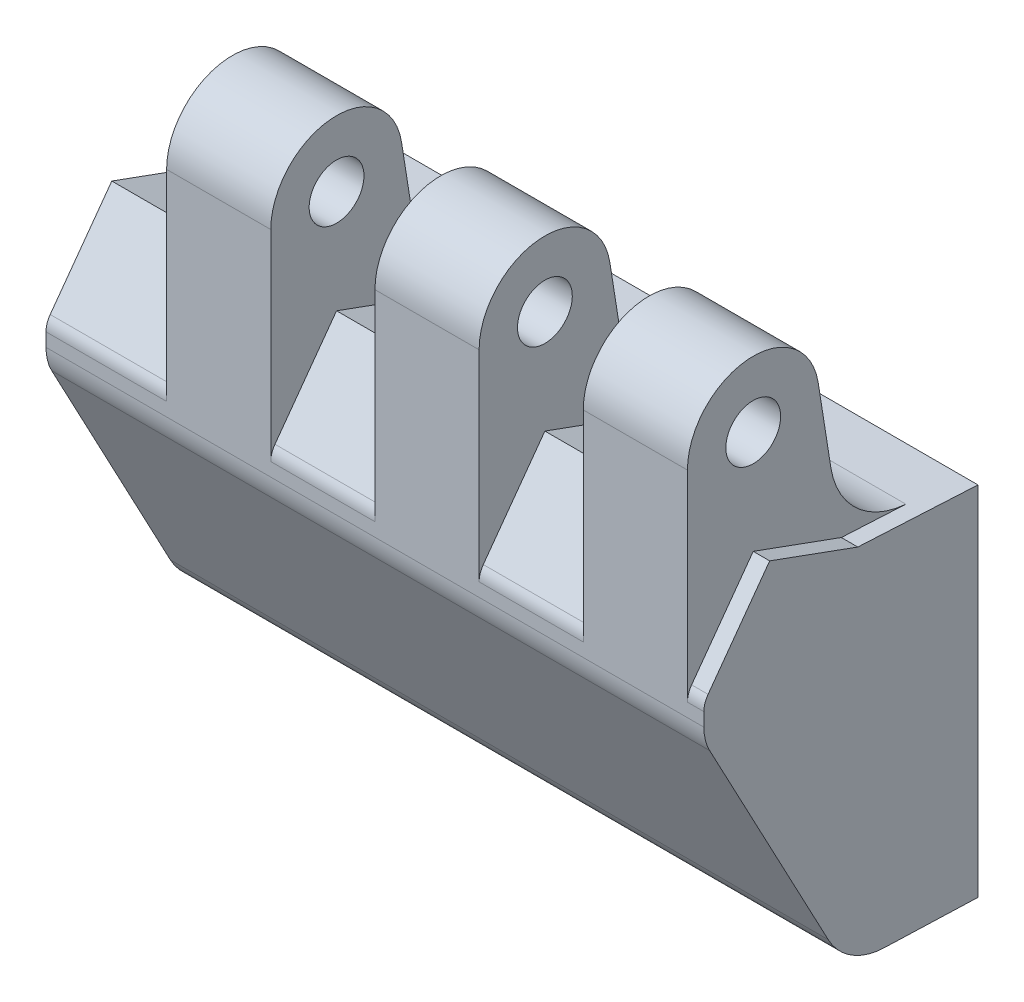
ISO-10303-21;
HEADER;
FILE_DESCRIPTION(('STEP AP214'),'2;1');
FILE_NAME('part.step','',(''),(''),'','','');
FILE_SCHEMA(('AUTOMOTIVE_DESIGN { 1 0 10303 214 1 1 1 1 }'));
ENDSEC;
DATA;
#1=APPLICATION_CONTEXT('core data for automotive mechanical design processes');
#2=APPLICATION_PROTOCOL_DEFINITION('international standard','automotive_design',2000,#1);
#3=PRODUCT_CONTEXT('',#1,'mechanical');
#4=PRODUCT('Part','Part','',(#3));
#5=PRODUCT_RELATED_PRODUCT_CATEGORY('part','',(#4));
#6=PRODUCT_DEFINITION_FORMATION('','',#4);
#7=PRODUCT_DEFINITION_CONTEXT('part definition',#1,'design');
#8=PRODUCT_DEFINITION('design','',#6,#7);
#9=PRODUCT_DEFINITION_SHAPE('','',#8);
#10=(LENGTH_UNIT() NAMED_UNIT(*) SI_UNIT(.MILLI.,.METRE.));
#11=(NAMED_UNIT(*) PLANE_ANGLE_UNIT() SI_UNIT($,.RADIAN.));
#12=(NAMED_UNIT(*) SI_UNIT($,.STERADIAN.) SOLID_ANGLE_UNIT());
#13=UNCERTAINTY_MEASURE_WITH_UNIT(LENGTH_MEASURE(1.E-05),#10,'distance_accuracy_value','');
#14=(GEOMETRIC_REPRESENTATION_CONTEXT(3) GLOBAL_UNCERTAINTY_ASSIGNED_CONTEXT((#13)) GLOBAL_UNIT_ASSIGNED_CONTEXT((#10,
#11,#12)) REPRESENTATION_CONTEXT('',''));
#15=CARTESIAN_POINT('',(0.,0.,0.));
#16=DIRECTION('',(0.,0.,1.));
#17=DIRECTION('',(1.,0.,0.));
#18=AXIS2_PLACEMENT_3D('',#15,#16,#17);
#19=CARTESIAN_POINT('',(-7.75,8.54,0.));
#20=DIRECTION('',(0.,0.998629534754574,-0.0523359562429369));
#21=DIRECTION('',(0.,0.0523359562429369,0.998629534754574));
#22=AXIS2_PLACEMENT_3D('',#19,#20,#21);
#23=PLANE('',#22);
#24=DIRECTION('',(1.,0.,0.));
#25=VECTOR('',#24,1.);
#26=CARTESIAN_POINT('',(-7.75,8.54,0.));
#27=LINE('',#26,#25);
#28=CARTESIAN_POINT('',(-7.5,8.54,0.));
#29=VERTEX_POINT('',#28);
#30=CARTESIAN_POINT('',(22.5,8.54,0.));
#31=VERTEX_POINT('',#30);
#32=EDGE_CURVE('E260',#29,#31,#27,.T.);
#33=ORIENTED_EDGE('',*,*,#32,.F.);
#34=DIRECTION('',(0.,-0.0523359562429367,-0.998629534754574));
#35=VECTOR('',#34,1.);
#36=CARTESIAN_POINT('',(-7.5,8.8272543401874,5.4811393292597));
#37=LINE('',#36,#35);
#38=CARTESIAN_POINT('',(-7.5,8.8272543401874,5.4811393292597));
#39=VERTEX_POINT('',#38);
#40=EDGE_CURVE('E242',#39,#29,#37,.T.);
#41=ORIENTED_EDGE('',*,*,#40,.F.);
#42=DIRECTION('',(1.,0.,0.));
#43=VECTOR('',#42,1.);
#44=CARTESIAN_POINT('',(-7.75,8.8272543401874,5.4811393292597));
#45=LINE('',#44,#43);
#46=CARTESIAN_POINT('',(-2.,8.8272543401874,5.4811393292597));
#47=VERTEX_POINT('',#46);
#48=EDGE_CURVE('E263',#39,#47,#45,.T.);
#49=ORIENTED_EDGE('',*,*,#48,.T.);
#50=DIRECTION('',(0.,0.0523359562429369,0.998629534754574));
#51=VECTOR('',#50,1.);
#52=CARTESIAN_POINT('',(-2.,8.54,0.));
#53=LINE('',#52,#51);
#54=CARTESIAN_POINT('',(-2.,8.67304490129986,2.53864794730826));
#55=VERTEX_POINT('',#54);
#56=EDGE_CURVE('E284',#55,#47,#53,.T.);
#57=ORIENTED_EDGE('',*,*,#56,.F.);
#58=DIRECTION('',(1.,0.,0.));
#59=VECTOR('',#58,1.);
#60=CARTESIAN_POINT('',(-2.,8.67304490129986,2.53864794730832));
#61=LINE('',#60,#59);
#62=CARTESIAN_POINT('',(2.75,8.67304490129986,2.53864794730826));
#63=VERTEX_POINT('',#62);
#64=EDGE_CURVE('E24',#63,#55,#61,.F.);
#65=ORIENTED_EDGE('',*,*,#64,.F.);
#66=DIRECTION('',(0.,0.0523359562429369,0.998629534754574));
#67=VECTOR('',#66,1.);
#68=CARTESIAN_POINT('',(2.75,8.54,0.));
#69=LINE('',#68,#67);
#70=CARTESIAN_POINT('',(2.75,8.8272543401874,5.4811393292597));
#71=VERTEX_POINT('',#70);
#72=EDGE_CURVE('E451',#63,#71,#69,.T.);
#73=ORIENTED_EDGE('',*,*,#72,.T.);
#74=CARTESIAN_POINT('',(7.5,8.8272543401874,5.4811393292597));
#75=VERTEX_POINT('',#74);
#76=EDGE_CURVE('E377',#71,#75,#45,.T.);
#77=ORIENTED_EDGE('',*,*,#76,.T.);
#78=DIRECTION('',(0.,0.0523359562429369,0.998629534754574));
#79=VECTOR('',#78,1.);
#80=CARTESIAN_POINT('',(7.5,8.54,0.));
#81=LINE('',#80,#79);
#82=CARTESIAN_POINT('',(7.5,8.67304490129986,2.53864794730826));
#83=VERTEX_POINT('',#82);
#84=EDGE_CURVE('E345',#83,#75,#81,.T.);
#85=ORIENTED_EDGE('',*,*,#84,.F.);
#86=DIRECTION('',(-1.,0.,0.));
#87=VECTOR('',#86,1.);
#88=CARTESIAN_POINT('',(12.25,8.67304490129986,2.53864794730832));
#89=LINE('',#88,#87);
#90=CARTESIAN_POINT('',(12.25,8.67304490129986,2.53864794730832));
#91=VERTEX_POINT('',#90);
#92=EDGE_CURVE('E259',#83,#91,#89,.F.);
#93=ORIENTED_EDGE('',*,*,#92,.T.);
#94=DIRECTION('',(0.,0.0523359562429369,0.998629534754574));
#95=VECTOR('',#94,1.);
#96=CARTESIAN_POINT('',(12.25,8.54,0.));
#97=LINE('',#96,#95);
#98=CARTESIAN_POINT('',(12.25,8.8272543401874,5.4811393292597));
#99=VERTEX_POINT('',#98);
#100=EDGE_CURVE('E354',#91,#99,#97,.T.);
#101=ORIENTED_EDGE('',*,*,#100,.T.);
#102=CARTESIAN_POINT('',(17.,8.8272543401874,5.4811393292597));
#103=VERTEX_POINT('',#102);
#104=EDGE_CURVE('E378',#99,#103,#45,.T.);
#105=ORIENTED_EDGE('',*,*,#104,.T.);
#106=DIRECTION('',(0.,0.0523359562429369,0.998629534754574));
#107=VECTOR('',#106,1.);
#108=CARTESIAN_POINT('',(17.,8.54,0.));
#109=LINE('',#108,#107);
#110=CARTESIAN_POINT('',(17.,8.67304490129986,2.53864794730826));
#111=VERTEX_POINT('',#110);
#112=EDGE_CURVE('E383',#111,#103,#109,.T.);
#113=ORIENTED_EDGE('',*,*,#112,.F.);
#114=DIRECTION('',(-1.,0.,0.));
#115=VECTOR('',#114,1.);
#116=CARTESIAN_POINT('',(21.75,8.67304490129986,2.53864794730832));
#117=LINE('',#116,#115);
#118=CARTESIAN_POINT('',(21.75,8.67304490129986,2.53864794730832));
#119=VERTEX_POINT('',#118);
#120=EDGE_CURVE('E10',#111,#119,#117,.F.);
#121=ORIENTED_EDGE('',*,*,#120,.T.);
#122=DIRECTION('',(0.,0.0523359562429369,0.998629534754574));
#123=VECTOR('',#122,1.);
#124=CARTESIAN_POINT('',(21.75,8.54,0.));
#125=LINE('',#124,#123);
#126=CARTESIAN_POINT('',(21.75,8.8272543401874,5.4811393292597));
#127=VERTEX_POINT('',#126);
#128=EDGE_CURVE('E408',#119,#127,#125,.T.);
#129=ORIENTED_EDGE('',*,*,#128,.T.);
#130=CARTESIAN_POINT('',(22.5,8.8272543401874,5.4811393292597));
#131=VERTEX_POINT('',#130);
#132=EDGE_CURVE('E374',#127,#131,#45,.T.);
#133=ORIENTED_EDGE('',*,*,#132,.T.);
#134=DIRECTION('',(0.,0.0523359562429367,0.998629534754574));
#135=VECTOR('',#134,1.);
#136=CARTESIAN_POINT('',(22.5,8.54,0.));
#137=LINE('',#136,#135);
#138=EDGE_CURVE('E654',#31,#131,#137,.T.);
#139=ORIENTED_EDGE('',*,*,#138,.F.);
#140=EDGE_LOOP('',(#33,#41,#49,#57,#65,#73,#77,#85,#93,#101,#105,#113,#121,#129,#133,#139));
#141=FACE_BOUND('',#140,.T.);
#142=ADVANCED_FACE('F16',(#141),#23,.T.);
#143=CARTESIAN_POINT('',(-7.75,-7.600480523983,4.2816775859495));
#144=DIRECTION('',(0.,-0.999390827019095,0.0348994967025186));
#145=DIRECTION('',(0.,-0.0348994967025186,-0.999390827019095));
#146=AXIS2_PLACEMENT_3D('',#143,#144,#145);
#147=PLANE('',#146);
#148=DIRECTION('',(1.,0.,0.));
#149=VECTOR('',#148,1.);
#150=CARTESIAN_POINT('',(-7.75,-7.600480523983,4.2816775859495));
#151=LINE('',#150,#149);
#152=CARTESIAN_POINT('',(-7.5,-7.600480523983,4.2816775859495));
#153=VERTEX_POINT('',#152);
#154=CARTESIAN_POINT('',(22.5,-7.600480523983,4.2816775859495));
#155=VERTEX_POINT('',#154);
#156=EDGE_CURVE('E252',#153,#155,#151,.T.);
#157=ORIENTED_EDGE('',*,*,#156,.F.);
#158=DIRECTION('',(0.,0.0348994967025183,0.999390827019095));
#159=VECTOR('',#158,1.);
#160=CARTESIAN_POINT('',(-7.5,-7.75,0.));
#161=LINE('',#160,#159);
#162=CARTESIAN_POINT('',(-7.5,-7.75,0.));
#163=VERTEX_POINT('',#162);
#164=EDGE_CURVE('E239',#163,#153,#161,.T.);
#165=ORIENTED_EDGE('',*,*,#164,.F.);
#166=DIRECTION('',(1.,0.,0.));
#167=VECTOR('',#166,1.);
#168=CARTESIAN_POINT('',(-7.75,-7.75,0.));
#169=LINE('',#168,#167);
#170=CARTESIAN_POINT('',(22.5,-7.75,0.));
#171=VERTEX_POINT('',#170);
#172=EDGE_CURVE('E250',#163,#171,#169,.T.);
#173=ORIENTED_EDGE('',*,*,#172,.T.);
#174=DIRECTION('',(0.,-0.0348994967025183,-0.999390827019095));
#175=VECTOR('',#174,1.);
#176=CARTESIAN_POINT('',(22.5,-7.600480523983,4.2816775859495));
#177=LINE('',#176,#175);
#178=EDGE_CURVE('E658',#155,#171,#177,.T.);
#179=ORIENTED_EDGE('',*,*,#178,.F.);
#180=EDGE_LOOP('',(#157,#165,#173,#179));
#181=FACE_BOUND('',#180,.T.);
#182=ADVANCED_FACE('F18',(#181),#147,.T.);
#183=CARTESIAN_POINT('',(-7.75,-7.75,0.));
#184=DIRECTION('',(0.,0.,-1.));
#185=DIRECTION('',(-1.,0.,0.));
#186=AXIS2_PLACEMENT_3D('',#183,#184,#185);
#187=PLANE('',#186);
#188=CARTESIAN_POINT('',(0.,0.,0.));
#189=DIRECTION('',(0.,0.,-1.));
#190=DIRECTION('',(-1.,0.,0.));
#191=AXIS2_PLACEMENT_3D('',#188,#189,#190);
#192=CIRCLE('',#191,1.5);
#193=CARTESIAN_POINT('',(-1.5,0.,0.));
#194=VERTEX_POINT('',#193);
#195=EDGE_CURVE('E585',#194,#194,#192,.T.);
#196=ORIENTED_EDGE('',*,*,#195,.F.);
#197=EDGE_LOOP('',(#196));
#198=FACE_BOUND('',#197,.T.);
#199=CARTESIAN_POINT('',(15.,0.,0.));
#200=DIRECTION('',(0.,0.,-1.));
#201=DIRECTION('',(-1.,0.,0.));
#202=AXIS2_PLACEMENT_3D('',#199,#200,#201);
#203=CIRCLE('',#202,1.5);
#204=CARTESIAN_POINT('',(13.5,0.,0.));
#205=VERTEX_POINT('',#204);
#206=EDGE_CURVE('E588',#205,#205,#203,.T.);
#207=ORIENTED_EDGE('',*,*,#206,.F.);
#208=EDGE_LOOP('',(#207));
#209=FACE_BOUND('',#208,.T.);
#210=ORIENTED_EDGE('',*,*,#172,.F.);
#211=DIRECTION('',(0.,-1.,0.));
#212=VECTOR('',#211,1.);
#213=CARTESIAN_POINT('',(-7.5,8.54,0.));
#214=LINE('',#213,#212);
#215=EDGE_CURVE('E236',#29,#163,#214,.T.);
#216=ORIENTED_EDGE('',*,*,#215,.F.);
#217=ORIENTED_EDGE('',*,*,#32,.T.);
#218=DIRECTION('',(0.,1.,0.));
#219=VECTOR('',#218,1.);
#220=CARTESIAN_POINT('',(22.5,-7.75,0.));
#221=LINE('',#220,#219);
#222=EDGE_CURVE('E258',#171,#31,#221,.T.);
#223=ORIENTED_EDGE('',*,*,#222,.F.);
#224=EDGE_LOOP('',(#210,#216,#217,#223));
#225=FACE_BOUND('',#224,.T.);
#226=ADVANCED_FACE('F256',(#198,#209,#225),#187,.T.);
#227=CARTESIAN_POINT('',(-7.75,5.8359345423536,12.5));
#228=DIRECTION('',(0.,0.,1.));
#229=DIRECTION('',(1.,0.,0.));
#230=AXIS2_PLACEMENT_3D('',#227,#228,#229);
#231=PLANE('',#230);
#232=DIRECTION('',(1.,0.,0.));
#233=VECTOR('',#232,1.);
#234=CARTESIAN_POINT('',(-7.75,5.8359345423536,12.5));
#235=LINE('',#234,#233);
#236=CARTESIAN_POINT('',(-7.5,5.8359345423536,12.5));
#237=VERTEX_POINT('',#236);
#238=CARTESIAN_POINT('',(-2.,5.8359345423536,12.5));
#239=VERTEX_POINT('',#238);
#240=EDGE_CURVE('E363',#237,#239,#235,.T.);
#241=ORIENTED_EDGE('',*,*,#240,.F.);
#242=DIRECTION('',(0.,1.,0.));
#243=VECTOR('',#242,1.);
#244=CARTESIAN_POINT('',(-7.5,5.22184224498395,12.5));
#245=LINE('',#244,#243);
#246=CARTESIAN_POINT('',(-7.5,5.22184224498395,12.5));
#247=VERTEX_POINT('',#246);
#248=EDGE_CURVE('E31',#247,#237,#245,.T.);
#249=ORIENTED_EDGE('',*,*,#248,.F.);
#250=DIRECTION('',(1.,0.,0.));
#251=VECTOR('',#250,1.);
#252=CARTESIAN_POINT('',(-7.75,5.2218422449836,12.5));
#253=LINE('',#252,#251);
#254=CARTESIAN_POINT('',(22.5,5.2218422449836,12.5));
#255=VERTEX_POINT('',#254);
#256=EDGE_CURVE('E360',#247,#255,#253,.T.);
#257=ORIENTED_EDGE('',*,*,#256,.T.);
#258=DIRECTION('',(0.,-1.,0.));
#259=VECTOR('',#258,1.);
#260=CARTESIAN_POINT('',(22.5,5.8359345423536,12.5));
#261=LINE('',#260,#259);
#262=CARTESIAN_POINT('',(22.5,5.8359345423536,12.5));
#263=VERTEX_POINT('',#262);
#264=EDGE_CURVE('E540',#263,#255,#261,.T.);
#265=ORIENTED_EDGE('',*,*,#264,.F.);
#266=CARTESIAN_POINT('',(21.75,5.8359345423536,12.5));
#267=VERTEX_POINT('',#266);
#268=EDGE_CURVE('E362',#267,#263,#235,.T.);
#269=ORIENTED_EDGE('',*,*,#268,.F.);
#270=DIRECTION('',(0.,-1.,0.));
#271=VECTOR('',#270,1.);
#272=CARTESIAN_POINT('',(21.75,15.,12.5));
#273=LINE('',#272,#271);
#274=CARTESIAN_POINT('',(21.75,15.,12.5));
#275=VERTEX_POINT('',#274);
#276=EDGE_CURVE('E531',#275,#267,#273,.T.);
#277=ORIENTED_EDGE('',*,*,#276,.F.);
#278=DIRECTION('',(-1.,0.,0.));
#279=VECTOR('',#278,1.);
#280=CARTESIAN_POINT('',(21.75,15.,12.5));
#281=LINE('',#280,#279);
#282=CARTESIAN_POINT('',(17.,15.,12.5));
#283=VERTEX_POINT('',#282);
#284=EDGE_CURVE('E628',#275,#283,#281,.T.);
#285=ORIENTED_EDGE('',*,*,#284,.T.);
#286=DIRECTION('',(0.,-1.,0.));
#287=VECTOR('',#286,1.);
#288=CARTESIAN_POINT('',(17.,15.,12.5));
#289=LINE('',#288,#287);
#290=CARTESIAN_POINT('',(17.,5.8359345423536,12.5));
#291=VERTEX_POINT('',#290);
#292=EDGE_CURVE('E600',#283,#291,#289,.T.);
#293=ORIENTED_EDGE('',*,*,#292,.T.);
#294=CARTESIAN_POINT('',(12.25,5.8359345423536,12.5));
#295=VERTEX_POINT('',#294);
#296=EDGE_CURVE('E367',#295,#291,#235,.T.);
#297=ORIENTED_EDGE('',*,*,#296,.F.);
#298=DIRECTION('',(0.,-1.,0.));
#299=VECTOR('',#298,1.);
#300=CARTESIAN_POINT('',(12.25,15.,12.5));
#301=LINE('',#300,#299);
#302=CARTESIAN_POINT('',(12.25,15.,12.5));
#303=VERTEX_POINT('',#302);
#304=EDGE_CURVE('E315',#303,#295,#301,.T.);
#305=ORIENTED_EDGE('',*,*,#304,.F.);
#306=DIRECTION('',(-1.,0.,0.));
#307=VECTOR('',#306,1.);
#308=CARTESIAN_POINT('',(12.25,15.,12.5));
#309=LINE('',#308,#307);
#310=CARTESIAN_POINT('',(7.5,15.,12.5));
#311=VERTEX_POINT('',#310);
#312=EDGE_CURVE('E327',#303,#311,#309,.T.);
#313=ORIENTED_EDGE('',*,*,#312,.T.);
#314=DIRECTION('',(0.,-1.,0.));
#315=VECTOR('',#314,1.);
#316=CARTESIAN_POINT('',(7.5,15.,12.5));
#317=LINE('',#316,#315);
#318=CARTESIAN_POINT('',(7.5,5.8359345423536,12.5));
#319=VERTEX_POINT('',#318);
#320=EDGE_CURVE('E292',#311,#319,#317,.T.);
#321=ORIENTED_EDGE('',*,*,#320,.T.);
#322=CARTESIAN_POINT('',(2.75,5.8359345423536,12.5));
#323=VERTEX_POINT('',#322);
#324=EDGE_CURVE('E366',#323,#319,#235,.T.);
#325=ORIENTED_EDGE('',*,*,#324,.F.);
#326=DIRECTION('',(0.,-1.,0.));
#327=VECTOR('',#326,1.);
#328=CARTESIAN_POINT('',(2.75,15.,12.5));
#329=LINE('',#328,#327);
#330=CARTESIAN_POINT('',(2.75,15.,12.5));
#331=VERTEX_POINT('',#330);
#332=EDGE_CURVE('E410',#331,#323,#329,.T.);
#333=ORIENTED_EDGE('',*,*,#332,.F.);
#334=DIRECTION('',(1.,0.,0.));
#335=VECTOR('',#334,1.);
#336=CARTESIAN_POINT('',(-2.,15.,12.5));
#337=LINE('',#336,#335);
#338=CARTESIAN_POINT('',(-2.,15.,12.5));
#339=VERTEX_POINT('',#338);
#340=EDGE_CURVE('E436',#339,#331,#337,.T.);
#341=ORIENTED_EDGE('',*,*,#340,.F.);
#342=DIRECTION('',(0.,-1.,0.));
#343=VECTOR('',#342,1.);
#344=CARTESIAN_POINT('',(-2.,15.,12.5));
#345=LINE('',#344,#343);
#346=EDGE_CURVE('E289',#339,#239,#345,.T.);
#347=ORIENTED_EDGE('',*,*,#346,.T.);
#348=EDGE_LOOP('',(#241,#249,#257,#265,#269,#277,#285,#293,#297,#305,#313,#321,#325,#333,#341,#347));
#349=FACE_BOUND('',#348,.T.);
#350=ADVANCED_FACE('F467',(#349),#231,.T.);
#351=CARTESIAN_POINT('',(-7.75,5.22184224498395,10.2499999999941));
#352=DIRECTION('',(1.,0.,0.));
#353=DIRECTION('',(0.,1.,0.));
#354=AXIS2_PLACEMENT_3D('',#351,#352,#353);
#355=CYLINDRICAL_SURFACE('',#354,2.2500000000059);
#356=ORIENTED_EDGE('',*,*,#256,.F.);
#357=CARTESIAN_POINT('',(-7.5,5.22184224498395,10.2499999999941));
#358=DIRECTION('',(-1.,0.,0.));
#359=DIRECTION('',(0.,0.,1.));
#360=AXIS2_PLACEMENT_3D('',#357,#358,#359);
#361=CIRCLE('',#360,2.2500000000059);
#362=CARTESIAN_POINT('',(-7.5,4.165531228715,12.236632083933));
#363=VERTEX_POINT('',#362);
#364=EDGE_CURVE('E676',#363,#247,#361,.T.);
#365=ORIENTED_EDGE('',*,*,#364,.F.);
#366=DIRECTION('',(1.,0.,0.));
#367=VECTOR('',#366,1.);
#368=CARTESIAN_POINT('',(-7.75,4.165531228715,12.236632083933));
#369=LINE('',#368,#367);
#370=CARTESIAN_POINT('',(22.5,4.165531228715,12.236632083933));
#371=VERTEX_POINT('',#370);
#372=EDGE_CURVE('E358',#363,#371,#369,.T.);
#373=ORIENTED_EDGE('',*,*,#372,.T.);
#374=CARTESIAN_POINT('',(22.5,5.22184224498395,10.2499999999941));
#375=DIRECTION('',(1.,0.,0.));
#376=DIRECTION('',(0.,0.,-1.));
#377=AXIS2_PLACEMENT_3D('',#374,#375,#376);
#378=CIRCLE('',#377,2.2500000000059);
#379=EDGE_CURVE('E595',#255,#371,#378,.T.);
#380=ORIENTED_EDGE('',*,*,#379,.F.);
#381=EDGE_LOOP('',(#356,#365,#373,#380));
#382=FACE_BOUND('',#381,.T.);
#383=ADVANCED_FACE('F580',(#382),#355,.T.);
#384=CARTESIAN_POINT('',(-7.75,4.165531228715,12.236632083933));
#385=DIRECTION('',(0.,-0.469471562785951,0.882947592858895));
#386=DIRECTION('',(0.,-0.882947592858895,-0.469471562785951));
#387=AXIS2_PLACEMENT_3D('',#384,#385,#386);
#388=PLANE('',#387);
#389=ORIENTED_EDGE('',*,*,#372,.F.);
#390=DIRECTION('',(0.,0.882947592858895,0.469471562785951));
#391=VECTOR('',#390,1.);
#392=CARTESIAN_POINT('',(-7.5,-6.010722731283,6.8258218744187));
#393=LINE('',#392,#391);
#394=CARTESIAN_POINT('',(-7.5,-6.010722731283,6.82582187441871));
#395=VERTEX_POINT('',#394);
#396=EDGE_CURVE('E674',#395,#363,#393,.T.);
#397=ORIENTED_EDGE('',*,*,#396,.F.);
#398=DIRECTION('',(1.,0.,0.));
#399=VECTOR('',#398,1.);
#400=CARTESIAN_POINT('',(-7.75,-6.010722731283,6.8258218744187));
#401=LINE('',#400,#399);
#402=CARTESIAN_POINT('',(22.5,-6.010722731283,6.8258218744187));
#403=VERTEX_POINT('',#402);
#404=EDGE_CURVE('E39',#395,#403,#401,.T.);
#405=ORIENTED_EDGE('',*,*,#404,.T.);
#406=DIRECTION('',(0.,-0.882947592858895,-0.469471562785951));
#407=VECTOR('',#406,1.);
#408=CARTESIAN_POINT('',(22.5,4.165531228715,12.236632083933));
#409=LINE('',#408,#407);
#410=EDGE_CURVE('E591',#371,#403,#409,.T.);
#411=ORIENTED_EDGE('',*,*,#410,.F.);
#412=EDGE_LOOP('',(#389,#397,#405,#411));
#413=FACE_BOUND('',#412,.T.);
#414=ADVANCED_FACE('F673',(#413),#388,.T.);
#415=CARTESIAN_POINT('',(-7.75,-4.60230804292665,4.1769790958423));
#416=DIRECTION('',(1.,0.,0.));
#417=DIRECTION('',(0.,1.,0.));
#418=AXIS2_PLACEMENT_3D('',#415,#416,#417);
#419=CYLINDRICAL_SURFACE('',#418,2.99999999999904);
#420=ORIENTED_EDGE('',*,*,#404,.F.);
#421=CARTESIAN_POINT('',(-7.5,-4.60230804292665,4.1769790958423));
#422=DIRECTION('',(-1.,0.,0.));
#423=DIRECTION('',(0.,0.,1.));
#424=AXIS2_PLACEMENT_3D('',#421,#422,#423);
#425=CIRCLE('',#424,2.99999999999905);
#426=EDGE_CURVE('E253',#153,#395,#425,.T.);
#427=ORIENTED_EDGE('',*,*,#426,.F.);
#428=ORIENTED_EDGE('',*,*,#156,.T.);
#429=CARTESIAN_POINT('',(22.5,-4.60230804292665,4.1769790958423));
#430=DIRECTION('',(1.,0.,0.));
#431=DIRECTION('',(0.,0.,-1.));
#432=AXIS2_PLACEMENT_3D('',#429,#430,#431);
#433=CIRCLE('',#432,2.99999999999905);
#434=EDGE_CURVE('E688',#403,#155,#433,.T.);
#435=ORIENTED_EDGE('',*,*,#434,.F.);
#436=EDGE_LOOP('',(#420,#427,#428,#435));
#437=FACE_BOUND('',#436,.T.);
#438=ADVANCED_FACE('F690',(#437),#419,.T.);
#439=CARTESIAN_POINT('',(-7.75,8.8272543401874,5.4811393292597));
#440=DIRECTION('',(0.,0.939692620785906,-0.342020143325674));
#441=DIRECTION('',(0.,0.342020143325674,0.939692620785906));
#442=AXIS2_PLACEMENT_3D('',#439,#440,#441);
#443=PLANE('',#442);
#444=ORIENTED_EDGE('',*,*,#48,.F.);
#445=DIRECTION('',(0.,-0.342020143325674,-0.939692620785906));
#446=VECTOR('',#445,1.);
#447=CARTESIAN_POINT('',(-7.5,10.29,9.5));
#448=LINE('',#447,#446);
#449=CARTESIAN_POINT('',(-7.5,10.29,9.5));
#450=VERTEX_POINT('',#449);
#451=EDGE_CURVE('E685',#450,#39,#448,.T.);
#452=ORIENTED_EDGE('',*,*,#451,.F.);
#453=DIRECTION('',(1.,0.,0.));
#454=VECTOR('',#453,1.);
#455=CARTESIAN_POINT('',(-7.75,10.29,9.5));
#456=LINE('',#455,#454);
#457=CARTESIAN_POINT('',(-2.,10.29,9.5));
#458=VERTEX_POINT('',#457);
#459=EDGE_CURVE('E373',#450,#458,#456,.T.);
#460=ORIENTED_EDGE('',*,*,#459,.T.);
#461=DIRECTION('',(0.,0.342020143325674,0.939692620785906));
#462=VECTOR('',#461,1.);
#463=CARTESIAN_POINT('',(-2.,8.8272543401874,5.4811393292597));
#464=LINE('',#463,#462);
#465=EDGE_CURVE('E293',#47,#458,#464,.T.);
#466=ORIENTED_EDGE('',*,*,#465,.F.);
#467=EDGE_LOOP('',(#444,#452,#460,#466));
#468=FACE_BOUND('',#467,.T.);
#469=ADVANCED_FACE('F573',(#468),#443,.T.);
#470=CARTESIAN_POINT('',(-7.75,10.29,9.5));
#471=DIRECTION('',(0.,0.587785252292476,0.809016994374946));
#472=DIRECTION('',(0.,-0.809016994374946,0.587785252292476));
#473=AXIS2_PLACEMENT_3D('',#470,#471,#472);
#474=PLANE('',#473);
#475=ORIENTED_EDGE('',*,*,#459,.F.);
#476=DIRECTION('',(0.,0.809016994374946,-0.587785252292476));
#477=VECTOR('',#476,1.);
#478=CARTESIAN_POINT('',(-7.5,6.423719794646,12.309016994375));
#479=LINE('',#478,#477);
#480=CARTESIAN_POINT('',(-7.5,6.423719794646,12.309016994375));
#481=VERTEX_POINT('',#480);
#482=EDGE_CURVE('E683',#481,#450,#479,.T.);
#483=ORIENTED_EDGE('',*,*,#482,.F.);
#484=DIRECTION('',(1.,0.,0.));
#485=VECTOR('',#484,1.);
#486=CARTESIAN_POINT('',(-7.75,6.423719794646,12.309016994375));
#487=LINE('',#486,#485);
#488=CARTESIAN_POINT('',(-2.,6.423719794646,12.309016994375));
#489=VERTEX_POINT('',#488);
#490=EDGE_CURVE('E368',#481,#489,#487,.T.);
#491=ORIENTED_EDGE('',*,*,#490,.T.);
#492=DIRECTION('',(0.,-0.809016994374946,0.587785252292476));
#493=VECTOR('',#492,1.);
#494=CARTESIAN_POINT('',(-2.,10.29,9.5));
#495=LINE('',#494,#493);
#496=EDGE_CURVE('E299',#458,#489,#495,.T.);
#497=ORIENTED_EDGE('',*,*,#496,.F.);
#498=EDGE_LOOP('',(#475,#483,#491,#497));
#499=FACE_BOUND('',#498,.T.);
#500=ADVANCED_FACE('F697',(#499),#474,.T.);
#501=CARTESIAN_POINT('',(-7.75,5.83593454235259,11.4999999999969));
#502=DIRECTION('',(1.,0.,0.));
#503=DIRECTION('',(0.,1.,0.));
#504=AXIS2_PLACEMENT_3D('',#501,#502,#503);
#505=CYLINDRICAL_SURFACE('',#504,1.00000000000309);
#506=ORIENTED_EDGE('',*,*,#490,.F.);
#507=CARTESIAN_POINT('',(-7.5,5.83593454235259,11.4999999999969));
#508=DIRECTION('',(-1.,0.,0.));
#509=DIRECTION('',(0.,0.,1.));
#510=AXIS2_PLACEMENT_3D('',#507,#508,#509);
#511=CIRCLE('',#510,1.0000000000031);
#512=EDGE_CURVE('E465',#237,#481,#511,.T.);
#513=ORIENTED_EDGE('',*,*,#512,.F.);
#514=ORIENTED_EDGE('',*,*,#240,.T.);
#515=CARTESIAN_POINT('',(-2.,5.83593454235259,11.4999999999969));
#516=DIRECTION('',(-1.,0.,0.));
#517=DIRECTION('',(0.,-1.,0.));
#518=AXIS2_PLACEMENT_3D('',#515,#516,#517);
#519=CIRCLE('',#518,1.00000000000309);
#520=EDGE_CURVE('E453',#489,#239,#519,.F.);
#521=ORIENTED_EDGE('',*,*,#520,.F.);
#522=EDGE_LOOP('',(#506,#513,#514,#521));
#523=FACE_BOUND('',#522,.T.);
#524=ADVANCED_FACE('F463',(#523),#505,.T.);
#525=CARTESIAN_POINT('',(21.75,10.29,9.5));
#526=VERTEX_POINT('',#525);
#527=CARTESIAN_POINT('',(22.5,10.29,9.5));
#528=VERTEX_POINT('',#527);
#529=EDGE_CURVE('E370',#526,#528,#456,.T.);
#530=ORIENTED_EDGE('',*,*,#529,.T.);
#531=DIRECTION('',(0.,0.342020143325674,0.939692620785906));
#532=VECTOR('',#531,1.);
#533=CARTESIAN_POINT('',(22.5,8.8272543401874,5.4811393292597));
#534=LINE('',#533,#532);
#535=EDGE_CURVE('E515',#131,#528,#534,.T.);
#536=ORIENTED_EDGE('',*,*,#535,.F.);
#537=ORIENTED_EDGE('',*,*,#132,.F.);
#538=DIRECTION('',(0.,0.342020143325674,0.939692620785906));
#539=VECTOR('',#538,1.);
#540=CARTESIAN_POINT('',(21.75,8.8272543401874,5.4811393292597));
#541=LINE('',#540,#539);
#542=EDGE_CURVE('E406',#127,#526,#541,.T.);
#543=ORIENTED_EDGE('',*,*,#542,.T.);
#544=EDGE_LOOP('',(#530,#536,#537,#543));
#545=FACE_BOUND('',#544,.T.);
#546=ADVANCED_FACE('F513',(#545),#443,.T.);
#547=CARTESIAN_POINT('',(21.75,6.423719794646,12.309016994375));
#548=VERTEX_POINT('',#547);
#549=CARTESIAN_POINT('',(22.5,6.423719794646,12.309016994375));
#550=VERTEX_POINT('',#549);
#551=EDGE_CURVE('E365',#548,#550,#487,.T.);
#552=ORIENTED_EDGE('',*,*,#551,.T.);
#553=DIRECTION('',(0.,-0.809016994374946,0.587785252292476));
#554=VECTOR('',#553,1.);
#555=CARTESIAN_POINT('',(22.5,10.29,9.5));
#556=LINE('',#555,#554);
#557=EDGE_CURVE('E523',#528,#550,#556,.T.);
#558=ORIENTED_EDGE('',*,*,#557,.F.);
#559=ORIENTED_EDGE('',*,*,#529,.F.);
#560=DIRECTION('',(0.,-0.809016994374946,0.587785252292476));
#561=VECTOR('',#560,1.);
#562=CARTESIAN_POINT('',(21.75,10.29,9.5));
#563=LINE('',#562,#561);
#564=EDGE_CURVE('E399',#526,#548,#563,.T.);
#565=ORIENTED_EDGE('',*,*,#564,.T.);
#566=EDGE_LOOP('',(#552,#558,#559,#565));
#567=FACE_BOUND('',#566,.T.);
#568=ADVANCED_FACE('F521',(#567),#474,.T.);
#569=ORIENTED_EDGE('',*,*,#268,.T.);
#570=CARTESIAN_POINT('',(22.5,5.83593454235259,11.4999999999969));
#571=DIRECTION('',(1.,0.,0.));
#572=DIRECTION('',(0.,0.,-1.));
#573=AXIS2_PLACEMENT_3D('',#570,#571,#572);
#574=CIRCLE('',#573,1.0000000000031);
#575=EDGE_CURVE('E663',#550,#263,#574,.T.);
#576=ORIENTED_EDGE('',*,*,#575,.F.);
#577=ORIENTED_EDGE('',*,*,#551,.F.);
#578=CARTESIAN_POINT('',(21.75,5.83593454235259,11.4999999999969));
#579=DIRECTION('',(-1.,0.,0.));
#580=DIRECTION('',(0.,-1.,0.));
#581=AXIS2_PLACEMENT_3D('',#578,#579,#580);
#582=CIRCLE('',#581,1.00000000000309);
#583=EDGE_CURVE('E397',#548,#267,#582,.F.);
#584=ORIENTED_EDGE('',*,*,#583,.T.);
#585=EDGE_LOOP('',(#569,#576,#577,#584));
#586=FACE_BOUND('',#585,.T.);
#587=ADVANCED_FACE('F535',(#586),#505,.T.);
#588=ORIENTED_EDGE('',*,*,#76,.F.);
#589=DIRECTION('',(0.,0.342020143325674,0.939692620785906));
#590=VECTOR('',#589,1.);
#591=CARTESIAN_POINT('',(2.75,8.8272543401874,5.4811393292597));
#592=LINE('',#591,#590);
#593=CARTESIAN_POINT('',(2.75,10.29,9.5));
#594=VERTEX_POINT('',#593);
#595=EDGE_CURVE('E448',#71,#594,#592,.T.);
#596=ORIENTED_EDGE('',*,*,#595,.T.);
#597=CARTESIAN_POINT('',(7.5,10.29,9.5));
#598=VERTEX_POINT('',#597);
#599=EDGE_CURVE('E375',#594,#598,#456,.T.);
#600=ORIENTED_EDGE('',*,*,#599,.T.);
#601=DIRECTION('',(0.,0.342020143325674,0.939692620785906));
#602=VECTOR('',#601,1.);
#603=CARTESIAN_POINT('',(7.5,8.8272543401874,5.4811393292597));
#604=LINE('',#603,#602);
#605=EDGE_CURVE('E342',#75,#598,#604,.T.);
#606=ORIENTED_EDGE('',*,*,#605,.F.);
#607=EDGE_LOOP('',(#588,#596,#600,#606));
#608=FACE_BOUND('',#607,.T.);
#609=ADVANCED_FACE('F482',(#608),#443,.T.);
#610=ORIENTED_EDGE('',*,*,#599,.F.);
#611=DIRECTION('',(0.,-0.809016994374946,0.587785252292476));
#612=VECTOR('',#611,1.);
#613=CARTESIAN_POINT('',(2.75,10.29,9.5));
#614=LINE('',#613,#612);
#615=CARTESIAN_POINT('',(2.75,6.423719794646,12.309016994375));
#616=VERTEX_POINT('',#615);
#617=EDGE_CURVE('E445',#594,#616,#614,.T.);
#618=ORIENTED_EDGE('',*,*,#617,.T.);
#619=CARTESIAN_POINT('',(7.5,6.423719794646,12.309016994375));
#620=VERTEX_POINT('',#619);
#621=EDGE_CURVE('E371',#616,#620,#487,.T.);
#622=ORIENTED_EDGE('',*,*,#621,.T.);
#623=DIRECTION('',(0.,-0.809016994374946,0.587785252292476));
#624=VECTOR('',#623,1.);
#625=CARTESIAN_POINT('',(7.5,10.29,9.5));
#626=LINE('',#625,#624);
#627=EDGE_CURVE('E339',#598,#620,#626,.T.);
#628=ORIENTED_EDGE('',*,*,#627,.F.);
#629=EDGE_LOOP('',(#610,#618,#622,#628));
#630=FACE_BOUND('',#629,.T.);
#631=ADVANCED_FACE('F708',(#630),#474,.T.);
#632=ORIENTED_EDGE('',*,*,#621,.F.);
#633=CARTESIAN_POINT('',(2.75,5.83593454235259,11.4999999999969));
#634=DIRECTION('',(-1.,0.,0.));
#635=DIRECTION('',(0.,-1.,0.));
#636=AXIS2_PLACEMENT_3D('',#633,#634,#635);
#637=CIRCLE('',#636,1.00000000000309);
#638=EDGE_CURVE('E442',#616,#323,#637,.F.);
#639=ORIENTED_EDGE('',*,*,#638,.T.);
#640=ORIENTED_EDGE('',*,*,#324,.T.);
#641=CARTESIAN_POINT('',(7.5,5.83593454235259,11.4999999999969));
#642=DIRECTION('',(-1.,0.,0.));
#643=DIRECTION('',(0.,-1.,0.));
#644=AXIS2_PLACEMENT_3D('',#641,#642,#643);
#645=CIRCLE('',#644,1.00000000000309);
#646=EDGE_CURVE('E336',#620,#319,#645,.F.);
#647=ORIENTED_EDGE('',*,*,#646,.F.);
#648=EDGE_LOOP('',(#632,#639,#640,#647));
#649=FACE_BOUND('',#648,.T.);
#650=ADVANCED_FACE('F545',(#649),#505,.T.);
#651=DIRECTION('',(0.,0.342020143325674,0.939692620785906));
#652=VECTOR('',#651,1.);
#653=CARTESIAN_POINT('',(17.,8.8272543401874,5.4811393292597));
#654=LINE('',#653,#652);
#655=CARTESIAN_POINT('',(17.,10.29,9.5));
#656=VERTEX_POINT('',#655);
#657=EDGE_CURVE('E394',#103,#656,#654,.T.);
#658=ORIENTED_EDGE('',*,*,#657,.F.);
#659=ORIENTED_EDGE('',*,*,#104,.F.);
#660=DIRECTION('',(0.,0.342020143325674,0.939692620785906));
#661=VECTOR('',#660,1.);
#662=CARTESIAN_POINT('',(12.25,8.8272543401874,5.4811393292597));
#663=LINE('',#662,#661);
#664=CARTESIAN_POINT('',(12.25,10.29,9.5));
#665=VERTEX_POINT('',#664);
#666=EDGE_CURVE('E352',#99,#665,#663,.T.);
#667=ORIENTED_EDGE('',*,*,#666,.T.);
#668=EDGE_CURVE('E376',#665,#656,#456,.T.);
#669=ORIENTED_EDGE('',*,*,#668,.T.);
#670=EDGE_LOOP('',(#658,#659,#667,#669));
#671=FACE_BOUND('',#670,.T.);
#672=ADVANCED_FACE('F504',(#671),#443,.T.);
#673=DIRECTION('',(0.,-0.809016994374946,0.587785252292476));
#674=VECTOR('',#673,1.);
#675=CARTESIAN_POINT('',(17.,10.29,9.5));
#676=LINE('',#675,#674);
#677=CARTESIAN_POINT('',(17.,6.423719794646,12.309016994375));
#678=VERTEX_POINT('',#677);
#679=EDGE_CURVE('E401',#656,#678,#676,.T.);
#680=ORIENTED_EDGE('',*,*,#679,.F.);
#681=ORIENTED_EDGE('',*,*,#668,.F.);
#682=DIRECTION('',(0.,-0.809016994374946,0.587785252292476));
#683=VECTOR('',#682,1.);
#684=CARTESIAN_POINT('',(12.25,10.29,9.5));
#685=LINE('',#684,#683);
#686=CARTESIAN_POINT('',(12.25,6.423719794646,12.309016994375));
#687=VERTEX_POINT('',#686);
#688=EDGE_CURVE('E350',#665,#687,#685,.T.);
#689=ORIENTED_EDGE('',*,*,#688,.T.);
#690=EDGE_CURVE('E372',#687,#678,#487,.T.);
#691=ORIENTED_EDGE('',*,*,#690,.T.);
#692=EDGE_LOOP('',(#680,#681,#689,#691));
#693=FACE_BOUND('',#692,.T.);
#694=ADVANCED_FACE('F506',(#693),#474,.T.);
#695=CARTESIAN_POINT('',(17.,5.83593454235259,11.4999999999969));
#696=DIRECTION('',(-1.,0.,0.));
#697=DIRECTION('',(0.,-1.,0.));
#698=AXIS2_PLACEMENT_3D('',#695,#696,#697);
#699=CIRCLE('',#698,1.00000000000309);
#700=EDGE_CURVE('E636',#678,#291,#699,.F.);
#701=ORIENTED_EDGE('',*,*,#700,.F.);
#702=ORIENTED_EDGE('',*,*,#690,.F.);
#703=CARTESIAN_POINT('',(12.25,5.83593454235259,11.4999999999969));
#704=DIRECTION('',(-1.,0.,0.));
#705=DIRECTION('',(0.,-1.,0.));
#706=AXIS2_PLACEMENT_3D('',#703,#704,#705);
#707=CIRCLE('',#706,1.00000000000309);
#708=EDGE_CURVE('E348',#687,#295,#707,.F.);
#709=ORIENTED_EDGE('',*,*,#708,.T.);
#710=ORIENTED_EDGE('',*,*,#296,.T.);
#711=EDGE_LOOP('',(#701,#702,#709,#710));
#712=FACE_BOUND('',#711,.T.);
#713=ADVANCED_FACE('F565',(#712),#505,.T.);
#714=CARTESIAN_POINT('',(12.25,12.4123793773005,2.25602155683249));
#715=DIRECTION('',(-1.,0.,0.));
#716=DIRECTION('',(0.,-1.,0.));
#717=AXIS2_PLACEMENT_3D('',#714,#715,#716);
#718=CYLINDRICAL_SURFACE('',#717,3.75000000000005);
#719=ORIENTED_EDGE('',*,*,#92,.F.);
#720=CARTESIAN_POINT('',(7.5,12.4123793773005,2.25602155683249));
#721=DIRECTION('',(-1.,0.,0.));
#722=DIRECTION('',(0.,1.,0.));
#723=AXIS2_PLACEMENT_3D('',#720,#721,#722);
#724=CIRCLE('',#723,3.75000000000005);
#725=CARTESIAN_POINT('',(7.5,11.8257501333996,5.9598528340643));
#726=VERTEX_POINT('',#725);
#727=EDGE_CURVE('E297',#83,#726,#724,.T.);
#728=ORIENTED_EDGE('',*,*,#727,.T.);
#729=DIRECTION('',(-1.,0.,0.));
#730=VECTOR('',#729,1.);
#731=CARTESIAN_POINT('',(12.25,11.8257501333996,5.9598528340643));
#732=LINE('',#731,#730);
#733=CARTESIAN_POINT('',(12.25,11.8257501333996,5.9598528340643));
#734=VERTEX_POINT('',#733);
#735=EDGE_CURVE('E333',#734,#726,#732,.T.);
#736=ORIENTED_EDGE('',*,*,#735,.F.);
#737=CARTESIAN_POINT('',(12.25,12.4123793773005,2.25602155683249));
#738=DIRECTION('',(-1.,0.,0.));
#739=DIRECTION('',(0.,1.,0.));
#740=AXIS2_PLACEMENT_3D('',#737,#738,#739);
#741=CIRCLE('',#740,3.75000000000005);
#742=EDGE_CURVE('E316',#91,#734,#741,.T.);
#743=ORIENTED_EDGE('',*,*,#742,.F.);
#744=EDGE_LOOP('',(#719,#728,#736,#743));
#745=FACE_BOUND('',#744,.T.);
#746=ADVANCED_FACE('F493',(#745),#718,.F.);
#747=CARTESIAN_POINT('',(12.25,11.8257501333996,5.9598528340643));
#748=DIRECTION('',(0.,-0.156434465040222,0.987688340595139));
#749=DIRECTION('',(0.,-0.987688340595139,-0.156434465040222));
#750=AXIS2_PLACEMENT_3D('',#747,#748,#749);
#751=PLANE('',#750);
#752=DIRECTION('',(0.,0.987688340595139,0.156434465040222));
#753=VECTOR('',#752,1.);
#754=CARTESIAN_POINT('',(7.5,11.8257501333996,5.9598528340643));
#755=LINE('',#754,#753);
#756=CARTESIAN_POINT('',(7.5,15.4693033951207,6.5369349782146));
#757=VERTEX_POINT('',#756);
#758=EDGE_CURVE('E305',#726,#757,#755,.T.);
#759=ORIENTED_EDGE('',*,*,#758,.T.);
#760=DIRECTION('',(-1.,0.,0.));
#761=VECTOR('',#760,1.);
#762=CARTESIAN_POINT('',(12.25,15.4693033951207,6.5369349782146));
#763=LINE('',#762,#761);
#764=CARTESIAN_POINT('',(12.25,15.4693033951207,6.5369349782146));
#765=VERTEX_POINT('',#764);
#766=EDGE_CURVE('E330',#765,#757,#763,.T.);
#767=ORIENTED_EDGE('',*,*,#766,.F.);
#768=DIRECTION('',(0.,0.987688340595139,0.156434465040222));
#769=VECTOR('',#768,1.);
#770=CARTESIAN_POINT('',(12.25,11.8257501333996,5.9598528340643));
#771=LINE('',#770,#769);
#772=EDGE_CURVE('E318',#734,#765,#771,.T.);
#773=ORIENTED_EDGE('',*,*,#772,.F.);
#774=ORIENTED_EDGE('',*,*,#735,.T.);
#775=EDGE_LOOP('',(#759,#767,#773,#774));
#776=FACE_BOUND('',#775,.T.);
#777=ADVANCED_FACE('F555',(#776),#751,.F.);
#778=CARTESIAN_POINT('',(12.25,15.,9.5));
#779=DIRECTION('',(-1.,0.,0.));
#780=DIRECTION('',(0.,-1.,0.));
#781=AXIS2_PLACEMENT_3D('',#778,#779,#780);
#782=CYLINDRICAL_SURFACE('',#781,3.);
#783=CARTESIAN_POINT('',(7.5,15.,9.5));
#784=DIRECTION('',(1.,0.,0.));
#785=DIRECTION('',(0.,-1.,0.));
#786=AXIS2_PLACEMENT_3D('',#783,#784,#785);
#787=CIRCLE('',#786,3.);
#788=EDGE_CURVE('E308',#757,#311,#787,.T.);
#789=ORIENTED_EDGE('',*,*,#788,.T.);
#790=ORIENTED_EDGE('',*,*,#312,.F.);
#791=CARTESIAN_POINT('',(12.25,15.,9.5));
#792=DIRECTION('',(1.,0.,0.));
#793=DIRECTION('',(0.,-1.,0.));
#794=AXIS2_PLACEMENT_3D('',#791,#792,#793);
#795=CIRCLE('',#794,3.);
#796=EDGE_CURVE('E320',#765,#303,#795,.T.);
#797=ORIENTED_EDGE('',*,*,#796,.F.);
#798=ORIENTED_EDGE('',*,*,#766,.T.);
#799=EDGE_LOOP('',(#789,#790,#797,#798));
#800=FACE_BOUND('',#799,.T.);
#801=ADVANCED_FACE('F553',(#800),#782,.T.);
#802=CARTESIAN_POINT('',(12.25,15.,9.5));
#803=DIRECTION('',(-1.,0.,0.));
#804=DIRECTION('',(0.,-1.,0.));
#805=AXIS2_PLACEMENT_3D('',#802,#803,#804);
#806=CYLINDRICAL_SURFACE('',#805,1.25);
#807=CARTESIAN_POINT('',(12.25,15.,9.5));
#808=DIRECTION('',(1.,0.,0.));
#809=DIRECTION('',(0.,1.,0.));
#810=AXIS2_PLACEMENT_3D('',#807,#808,#809);
#811=CIRCLE('',#810,1.25);
#812=CARTESIAN_POINT('',(12.25,16.25,9.5));
#813=VERTEX_POINT('',#812);
#814=EDGE_CURVE('E322',#813,#813,#811,.T.);
#815=ORIENTED_EDGE('',*,*,#814,.T.);
#816=EDGE_LOOP('',(#815));
#817=FACE_BOUND('',#816,.T.);
#818=CARTESIAN_POINT('',(7.5,15.,9.5));
#819=DIRECTION('',(1.,0.,0.));
#820=DIRECTION('',(0.,1.,0.));
#821=AXIS2_PLACEMENT_3D('',#818,#819,#820);
#822=CIRCLE('',#821,1.25);
#823=CARTESIAN_POINT('',(7.5,16.25,9.5));
#824=VERTEX_POINT('',#823);
#825=EDGE_CURVE('E310',#824,#824,#822,.T.);
#826=ORIENTED_EDGE('',*,*,#825,.F.);
#827=EDGE_LOOP('',(#826));
#828=FACE_BOUND('',#827,.T.);
#829=ADVANCED_FACE('F563',(#817,#828),#806,.F.);
#830=CARTESIAN_POINT('',(12.25,12.4123793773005,2.25602155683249));
#831=DIRECTION('',(-1.,0.,0.));
#832=DIRECTION('',(0.,-1.,0.));
#833=AXIS2_PLACEMENT_3D('',#830,#831,#832);
#834=PLANE('',#833);
#835=ORIENTED_EDGE('',*,*,#100,.F.);
#836=ORIENTED_EDGE('',*,*,#742,.T.);
#837=ORIENTED_EDGE('',*,*,#772,.T.);
#838=ORIENTED_EDGE('',*,*,#796,.T.);
#839=ORIENTED_EDGE('',*,*,#304,.T.);
#840=ORIENTED_EDGE('',*,*,#708,.F.);
#841=ORIENTED_EDGE('',*,*,#688,.F.);
#842=ORIENTED_EDGE('',*,*,#666,.F.);
#843=EDGE_LOOP('',(#835,#836,#837,#838,#839,#840,#841,#842));
#844=FACE_BOUND('',#843,.T.);
#845=ORIENTED_EDGE('',*,*,#814,.F.);
#846=EDGE_LOOP('',(#845));
#847=FACE_BOUND('',#846,.T.);
#848=ADVANCED_FACE('F497',(#844,#847),#834,.F.);
#849=CARTESIAN_POINT('',(7.5,12.4123793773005,2.25602155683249));
#850=DIRECTION('',(-1.,0.,0.));
#851=DIRECTION('',(0.,-1.,0.));
#852=AXIS2_PLACEMENT_3D('',#849,#850,#851);
#853=PLANE('',#852);
#854=ORIENTED_EDGE('',*,*,#727,.F.);
#855=ORIENTED_EDGE('',*,*,#84,.T.);
#856=ORIENTED_EDGE('',*,*,#605,.T.);
#857=ORIENTED_EDGE('',*,*,#627,.T.);
#858=ORIENTED_EDGE('',*,*,#646,.T.);
#859=ORIENTED_EDGE('',*,*,#320,.F.);
#860=ORIENTED_EDGE('',*,*,#788,.F.);
#861=ORIENTED_EDGE('',*,*,#758,.F.);
#862=EDGE_LOOP('',(#854,#855,#856,#857,#858,#859,#860,#861));
#863=FACE_BOUND('',#862,.T.);
#864=ORIENTED_EDGE('',*,*,#825,.T.);
#865=EDGE_LOOP('',(#864));
#866=FACE_BOUND('',#865,.T.);
#867=ADVANCED_FACE('F487',(#863,#866),#853,.T.);
#868=CARTESIAN_POINT('',(-2.,12.4123793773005,2.25602155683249));
#869=DIRECTION('',(1.,0.,0.));
#870=DIRECTION('',(0.,1.,0.));
#871=AXIS2_PLACEMENT_3D('',#868,#869,#870);
#872=CYLINDRICAL_SURFACE('',#871,3.75000000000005);
#873=CARTESIAN_POINT('',(2.75,12.4123793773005,2.25602155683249));
#874=DIRECTION('',(-1.,0.,0.));
#875=DIRECTION('',(0.,1.,0.));
#876=AXIS2_PLACEMENT_3D('',#873,#874,#875);
#877=CIRCLE('',#876,3.75000000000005);
#878=CARTESIAN_POINT('',(2.75,11.8257501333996,5.9598528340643));
#879=VERTEX_POINT('',#878);
#880=EDGE_CURVE('E274',#63,#879,#877,.T.);
#881=ORIENTED_EDGE('',*,*,#880,.F.);
#882=ORIENTED_EDGE('',*,*,#64,.T.);
#883=CARTESIAN_POINT('',(-2.,12.4123793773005,2.25602155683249));
#884=DIRECTION('',(-1.,0.,0.));
#885=DIRECTION('',(0.,1.,0.));
#886=AXIS2_PLACEMENT_3D('',#883,#884,#885);
#887=CIRCLE('',#886,3.75000000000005);
#888=CARTESIAN_POINT('',(-2.,11.8257501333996,5.9598528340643));
#889=VERTEX_POINT('',#888);
#890=EDGE_CURVE('E272',#55,#889,#887,.T.);
#891=ORIENTED_EDGE('',*,*,#890,.T.);
#892=DIRECTION('',(1.,0.,0.));
#893=VECTOR('',#892,1.);
#894=CARTESIAN_POINT('',(-2.,11.8257501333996,5.9598528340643));
#895=LINE('',#894,#893);
#896=EDGE_CURVE('E440',#889,#879,#895,.T.);
#897=ORIENTED_EDGE('',*,*,#896,.T.);
#898=EDGE_LOOP('',(#881,#882,#891,#897));
#899=FACE_BOUND('',#898,.T.);
#900=ADVANCED_FACE('F270',(#899),#872,.F.);
#901=CARTESIAN_POINT('',(-2.,11.8257501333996,5.9598528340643));
#902=DIRECTION('',(0.,0.156434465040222,-0.987688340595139));
#903=DIRECTION('',(0.,0.987688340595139,0.156434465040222));
#904=AXIS2_PLACEMENT_3D('',#901,#902,#903);
#905=PLANE('',#904);
#906=DIRECTION('',(0.,0.987688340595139,0.156434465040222));
#907=VECTOR('',#906,1.);
#908=CARTESIAN_POINT('',(2.75,11.8257501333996,5.9598528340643));
#909=LINE('',#908,#907);
#910=CARTESIAN_POINT('',(2.75,15.4693033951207,6.5369349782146));
#911=VERTEX_POINT('',#910);
#912=EDGE_CURVE('E413',#879,#911,#909,.T.);
#913=ORIENTED_EDGE('',*,*,#912,.F.);
#914=ORIENTED_EDGE('',*,*,#896,.F.);
#915=DIRECTION('',(0.,0.987688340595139,0.156434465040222));
#916=VECTOR('',#915,1.);
#917=CARTESIAN_POINT('',(-2.,11.8257501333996,5.9598528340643));
#918=LINE('',#917,#916);
#919=CARTESIAN_POINT('',(-2.,15.4693033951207,6.5369349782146));
#920=VERTEX_POINT('',#919);
#921=EDGE_CURVE('E288',#889,#920,#918,.T.);
#922=ORIENTED_EDGE('',*,*,#921,.T.);
#923=DIRECTION('',(1.,0.,0.));
#924=VECTOR('',#923,1.);
#925=CARTESIAN_POINT('',(-2.,15.4693033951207,6.5369349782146));
#926=LINE('',#925,#924);
#927=EDGE_CURVE('E438',#920,#911,#926,.T.);
#928=ORIENTED_EDGE('',*,*,#927,.T.);
#929=EDGE_LOOP('',(#913,#914,#922,#928));
#930=FACE_BOUND('',#929,.T.);
#931=ADVANCED_FACE('F475',(#930),#905,.T.);
#932=CARTESIAN_POINT('',(-2.,15.,9.5));
#933=DIRECTION('',(1.,0.,0.));
#934=DIRECTION('',(0.,1.,0.));
#935=AXIS2_PLACEMENT_3D('',#932,#933,#934);
#936=CYLINDRICAL_SURFACE('',#935,3.);
#937=CARTESIAN_POINT('',(2.75,15.,9.5));
#938=DIRECTION('',(1.,0.,0.));
#939=DIRECTION('',(0.,-1.,0.));
#940=AXIS2_PLACEMENT_3D('',#937,#938,#939);
#941=CIRCLE('',#940,3.);
#942=EDGE_CURVE('E417',#911,#331,#941,.T.);
#943=ORIENTED_EDGE('',*,*,#942,.F.);
#944=ORIENTED_EDGE('',*,*,#927,.F.);
#945=CARTESIAN_POINT('',(-2.,15.,9.5));
#946=DIRECTION('',(1.,0.,0.));
#947=DIRECTION('',(0.,-1.,0.));
#948=AXIS2_PLACEMENT_3D('',#945,#946,#947);
#949=CIRCLE('',#948,3.);
#950=EDGE_CURVE('E428',#920,#339,#949,.T.);
#951=ORIENTED_EDGE('',*,*,#950,.T.);
#952=ORIENTED_EDGE('',*,*,#340,.T.);
#953=EDGE_LOOP('',(#943,#944,#951,#952));
#954=FACE_BOUND('',#953,.T.);
#955=ADVANCED_FACE('F472',(#954),#936,.T.);
#956=CARTESIAN_POINT('',(-2.,15.,9.5));
#957=DIRECTION('',(1.,0.,0.));
#958=DIRECTION('',(0.,1.,0.));
#959=AXIS2_PLACEMENT_3D('',#956,#957,#958);
#960=CYLINDRICAL_SURFACE('',#959,1.25);
#961=CARTESIAN_POINT('',(-2.,15.,9.5));
#962=DIRECTION('',(1.,0.,0.));
#963=DIRECTION('',(0.,1.,0.));
#964=AXIS2_PLACEMENT_3D('',#961,#962,#963);
#965=CIRCLE('',#964,1.25);
#966=CARTESIAN_POINT('',(-2.,16.25,9.5));
#967=VERTEX_POINT('',#966);
#968=EDGE_CURVE('E431',#967,#967,#965,.T.);
#969=ORIENTED_EDGE('',*,*,#968,.F.);
#970=EDGE_LOOP('',(#969));
#971=FACE_BOUND('',#970,.T.);
#972=CARTESIAN_POINT('',(2.75,15.,9.5));
#973=DIRECTION('',(1.,0.,0.));
#974=DIRECTION('',(0.,1.,0.));
#975=AXIS2_PLACEMENT_3D('',#972,#973,#974);
#976=CIRCLE('',#975,1.25);
#977=CARTESIAN_POINT('',(2.75,16.25,9.5));
#978=VERTEX_POINT('',#977);
#979=EDGE_CURVE('E421',#978,#978,#976,.T.);
#980=ORIENTED_EDGE('',*,*,#979,.T.);
#981=EDGE_LOOP('',(#980));
#982=FACE_BOUND('',#981,.T.);
#983=ADVANCED_FACE('F857',(#971,#982),#960,.F.);
#984=CARTESIAN_POINT('',(-2.,12.4123793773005,2.25602155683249));
#985=DIRECTION('',(-1.,0.,0.));
#986=DIRECTION('',(0.,-1.,0.));
#987=AXIS2_PLACEMENT_3D('',#984,#985,#986);
#988=PLANE('',#987);
#989=ORIENTED_EDGE('',*,*,#890,.F.);
#990=ORIENTED_EDGE('',*,*,#56,.T.);
#991=ORIENTED_EDGE('',*,*,#465,.T.);
#992=ORIENTED_EDGE('',*,*,#496,.T.);
#993=ORIENTED_EDGE('',*,*,#520,.T.);
#994=ORIENTED_EDGE('',*,*,#346,.F.);
#995=ORIENTED_EDGE('',*,*,#950,.F.);
#996=ORIENTED_EDGE('',*,*,#921,.F.);
#997=EDGE_LOOP('',(#989,#990,#991,#992,#993,#994,#995,#996));
#998=FACE_BOUND('',#997,.T.);
#999=ORIENTED_EDGE('',*,*,#968,.T.);
#1000=EDGE_LOOP('',(#999));
#1001=FACE_BOUND('',#1000,.T.);
#1002=ADVANCED_FACE('F281',(#998,#1001),#988,.T.);
#1003=CARTESIAN_POINT('',(2.75,12.4123793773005,2.25602155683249));
#1004=DIRECTION('',(-1.,0.,0.));
#1005=DIRECTION('',(0.,-1.,0.));
#1006=AXIS2_PLACEMENT_3D('',#1003,#1004,#1005);
#1007=PLANE('',#1006);
#1008=ORIENTED_EDGE('',*,*,#72,.F.);
#1009=ORIENTED_EDGE('',*,*,#880,.T.);
#1010=ORIENTED_EDGE('',*,*,#912,.T.);
#1011=ORIENTED_EDGE('',*,*,#942,.T.);
#1012=ORIENTED_EDGE('',*,*,#332,.T.);
#1013=ORIENTED_EDGE('',*,*,#638,.F.);
#1014=ORIENTED_EDGE('',*,*,#617,.F.);
#1015=ORIENTED_EDGE('',*,*,#595,.F.);
#1016=EDGE_LOOP('',(#1008,#1009,#1010,#1011,#1012,#1013,#1014,#1015));
#1017=FACE_BOUND('',#1016,.T.);
#1018=ORIENTED_EDGE('',*,*,#979,.F.);
#1019=EDGE_LOOP('',(#1018));
#1020=FACE_BOUND('',#1019,.T.);
#1021=ADVANCED_FACE('F477',(#1017,#1020),#1007,.F.);
#1022=CARTESIAN_POINT('',(21.75,12.4123793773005,2.25602155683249));
#1023=DIRECTION('',(-1.,0.,0.));
#1024=DIRECTION('',(0.,-1.,0.));
#1025=AXIS2_PLACEMENT_3D('',#1022,#1023,#1024);
#1026=CYLINDRICAL_SURFACE('',#1025,3.75000000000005);
#1027=ORIENTED_EDGE('',*,*,#120,.F.);
#1028=CARTESIAN_POINT('',(17.,12.4123793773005,2.25602155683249));
#1029=DIRECTION('',(-1.,0.,0.));
#1030=DIRECTION('',(0.,1.,0.));
#1031=AXIS2_PLACEMENT_3D('',#1028,#1029,#1030);
#1032=CIRCLE('',#1031,3.75000000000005);
#1033=CARTESIAN_POINT('',(17.,11.8257501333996,5.9598528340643));
#1034=VERTEX_POINT('',#1033);
#1035=EDGE_CURVE('E396',#111,#1034,#1032,.T.);
#1036=ORIENTED_EDGE('',*,*,#1035,.T.);
#1037=DIRECTION('',(-1.,0.,0.));
#1038=VECTOR('',#1037,1.);
#1039=CARTESIAN_POINT('',(21.75,11.8257501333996,5.9598528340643));
#1040=LINE('',#1039,#1038);
#1041=CARTESIAN_POINT('',(21.75,11.8257501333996,5.9598528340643));
#1042=VERTEX_POINT('',#1041);
#1043=EDGE_CURVE('E633',#1042,#1034,#1040,.T.);
#1044=ORIENTED_EDGE('',*,*,#1043,.F.);
#1045=CARTESIAN_POINT('',(21.75,12.4123793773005,2.25602155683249));
#1046=DIRECTION('',(-1.,0.,0.));
#1047=DIRECTION('',(0.,1.,0.));
#1048=AXIS2_PLACEMENT_3D('',#1045,#1046,#1047);
#1049=CIRCLE('',#1048,3.75000000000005);
#1050=EDGE_CURVE('E618',#119,#1042,#1049,.T.);
#1051=ORIENTED_EDGE('',*,*,#1050,.F.);
#1052=EDGE_LOOP('',(#1027,#1036,#1044,#1051));
#1053=FACE_BOUND('',#1052,.T.);
#1054=ADVANCED_FACE('F652',(#1053),#1026,.F.);
#1055=CARTESIAN_POINT('',(21.75,11.8257501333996,5.9598528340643));
#1056=DIRECTION('',(0.,-0.156434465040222,0.987688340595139));
#1057=DIRECTION('',(0.,-0.987688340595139,-0.156434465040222));
#1058=AXIS2_PLACEMENT_3D('',#1055,#1056,#1057);
#1059=PLANE('',#1058);
#1060=DIRECTION('',(0.,0.987688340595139,0.156434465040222));
#1061=VECTOR('',#1060,1.);
#1062=CARTESIAN_POINT('',(17.,11.8257501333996,5.9598528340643));
#1063=LINE('',#1062,#1061);
#1064=CARTESIAN_POINT('',(17.,15.4693033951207,6.5369349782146));
#1065=VERTEX_POINT('',#1064);
#1066=EDGE_CURVE('E605',#1034,#1065,#1063,.T.);
#1067=ORIENTED_EDGE('',*,*,#1066,.T.);
#1068=DIRECTION('',(-1.,0.,0.));
#1069=VECTOR('',#1068,1.);
#1070=CARTESIAN_POINT('',(21.75,15.4693033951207,6.5369349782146));
#1071=LINE('',#1070,#1069);
#1072=CARTESIAN_POINT('',(21.75,15.4693033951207,6.5369349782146));
#1073=VERTEX_POINT('',#1072);
#1074=EDGE_CURVE('E630',#1073,#1065,#1071,.T.);
#1075=ORIENTED_EDGE('',*,*,#1074,.F.);
#1076=DIRECTION('',(0.,0.987688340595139,0.156434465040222));
#1077=VECTOR('',#1076,1.);
#1078=CARTESIAN_POINT('',(21.75,11.8257501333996,5.9598528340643));
#1079=LINE('',#1078,#1077);
#1080=EDGE_CURVE('E620',#1042,#1073,#1079,.T.);
#1081=ORIENTED_EDGE('',*,*,#1080,.F.);
#1082=ORIENTED_EDGE('',*,*,#1043,.T.);
#1083=EDGE_LOOP('',(#1067,#1075,#1081,#1082));
#1084=FACE_BOUND('',#1083,.T.);
#1085=ADVANCED_FACE('F647',(#1084),#1059,.F.);
#1086=CARTESIAN_POINT('',(21.75,15.,9.5));
#1087=DIRECTION('',(-1.,0.,0.));
#1088=DIRECTION('',(0.,-1.,0.));
#1089=AXIS2_PLACEMENT_3D('',#1086,#1087,#1088);
#1090=CYLINDRICAL_SURFACE('',#1089,3.);
#1091=CARTESIAN_POINT('',(17.,15.,9.5));
#1092=DIRECTION('',(1.,0.,0.));
#1093=DIRECTION('',(0.,-1.,0.));
#1094=AXIS2_PLACEMENT_3D('',#1091,#1092,#1093);
#1095=CIRCLE('',#1094,3.);
#1096=EDGE_CURVE('E608',#1065,#283,#1095,.T.);
#1097=ORIENTED_EDGE('',*,*,#1096,.T.);
#1098=ORIENTED_EDGE('',*,*,#284,.F.);
#1099=CARTESIAN_POINT('',(21.75,15.,9.5));
#1100=DIRECTION('',(1.,0.,0.));
#1101=DIRECTION('',(0.,-1.,0.));
#1102=AXIS2_PLACEMENT_3D('',#1099,#1100,#1101);
#1103=CIRCLE('',#1102,3.);
#1104=EDGE_CURVE('E622',#1073,#275,#1103,.T.);
#1105=ORIENTED_EDGE('',*,*,#1104,.F.);
#1106=ORIENTED_EDGE('',*,*,#1074,.T.);
#1107=EDGE_LOOP('',(#1097,#1098,#1105,#1106));
#1108=FACE_BOUND('',#1107,.T.);
#1109=ADVANCED_FACE('F644',(#1108),#1090,.T.);
#1110=CARTESIAN_POINT('',(21.75,15.,9.5));
#1111=DIRECTION('',(-1.,0.,0.));
#1112=DIRECTION('',(0.,-1.,0.));
#1113=AXIS2_PLACEMENT_3D('',#1110,#1111,#1112);
#1114=CYLINDRICAL_SURFACE('',#1113,1.25);
#1115=CARTESIAN_POINT('',(21.75,15.,9.5));
#1116=DIRECTION('',(1.,0.,0.));
#1117=DIRECTION('',(0.,1.,0.));
#1118=AXIS2_PLACEMENT_3D('',#1115,#1116,#1117);
#1119=CIRCLE('',#1118,1.25);
#1120=CARTESIAN_POINT('',(21.75,16.25,9.5));
#1121=VERTEX_POINT('',#1120);
#1122=EDGE_CURVE('E624',#1121,#1121,#1119,.T.);
#1123=ORIENTED_EDGE('',*,*,#1122,.T.);
#1124=EDGE_LOOP('',(#1123));
#1125=FACE_BOUND('',#1124,.T.);
#1126=CARTESIAN_POINT('',(17.,15.,9.5));
#1127=DIRECTION('',(1.,0.,0.));
#1128=DIRECTION('',(0.,1.,0.));
#1129=AXIS2_PLACEMENT_3D('',#1126,#1127,#1128);
#1130=CIRCLE('',#1129,1.25);
#1131=CARTESIAN_POINT('',(17.,16.25,9.5));
#1132=VERTEX_POINT('',#1131);
#1133=EDGE_CURVE('E611',#1132,#1132,#1130,.T.);
#1134=ORIENTED_EDGE('',*,*,#1133,.F.);
#1135=EDGE_LOOP('',(#1134));
#1136=FACE_BOUND('',#1135,.T.);
#1137=ADVANCED_FACE('F913',(#1125,#1136),#1114,.F.);
#1138=CARTESIAN_POINT('',(21.75,12.4123793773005,2.25602155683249));
#1139=DIRECTION('',(-1.,0.,0.));
#1140=DIRECTION('',(0.,-1.,0.));
#1141=AXIS2_PLACEMENT_3D('',#1138,#1139,#1140);
#1142=PLANE('',#1141);
#1143=ORIENTED_EDGE('',*,*,#128,.F.);
#1144=ORIENTED_EDGE('',*,*,#1050,.T.);
#1145=ORIENTED_EDGE('',*,*,#1080,.T.);
#1146=ORIENTED_EDGE('',*,*,#1104,.T.);
#1147=ORIENTED_EDGE('',*,*,#276,.T.);
#1148=ORIENTED_EDGE('',*,*,#583,.F.);
#1149=ORIENTED_EDGE('',*,*,#564,.F.);
#1150=ORIENTED_EDGE('',*,*,#542,.F.);
#1151=EDGE_LOOP('',(#1143,#1144,#1145,#1146,#1147,#1148,#1149,#1150));
#1152=FACE_BOUND('',#1151,.T.);
#1153=ORIENTED_EDGE('',*,*,#1122,.F.);
#1154=EDGE_LOOP('',(#1153));
#1155=FACE_BOUND('',#1154,.T.);
#1156=ADVANCED_FACE('F527',(#1152,#1155),#1142,.F.);
#1157=CARTESIAN_POINT('',(17.,12.4123793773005,2.25602155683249));
#1158=DIRECTION('',(-1.,0.,0.));
#1159=DIRECTION('',(0.,-1.,0.));
#1160=AXIS2_PLACEMENT_3D('',#1157,#1158,#1159);
#1161=PLANE('',#1160);
#1162=ORIENTED_EDGE('',*,*,#1035,.F.);
#1163=ORIENTED_EDGE('',*,*,#112,.T.);
#1164=ORIENTED_EDGE('',*,*,#657,.T.);
#1165=ORIENTED_EDGE('',*,*,#679,.T.);
#1166=ORIENTED_EDGE('',*,*,#700,.T.);
#1167=ORIENTED_EDGE('',*,*,#292,.F.);
#1168=ORIENTED_EDGE('',*,*,#1096,.F.);
#1169=ORIENTED_EDGE('',*,*,#1066,.F.);
#1170=EDGE_LOOP('',(#1162,#1163,#1164,#1165,#1166,#1167,#1168,#1169));
#1171=FACE_BOUND('',#1170,.T.);
#1172=ORIENTED_EDGE('',*,*,#1133,.T.);
#1173=EDGE_LOOP('',(#1172));
#1174=FACE_BOUND('',#1173,.T.);
#1175=ADVANCED_FACE('F391',(#1171,#1174),#1161,.T.);
#1176=CARTESIAN_POINT('',(0.,0.,4.));
#1177=DIRECTION('',(0.,0.,-1.));
#1178=DIRECTION('',(-1.,0.,0.));
#1179=AXIS2_PLACEMENT_3D('',#1176,#1177,#1178);
#1180=CYLINDRICAL_SURFACE('',#1179,1.5);
#1181=CARTESIAN_POINT('',(0.,0.,4.));
#1182=DIRECTION('',(0.,0.,-1.));
#1183=DIRECTION('',(-1.,0.,0.));
#1184=AXIS2_PLACEMENT_3D('',#1181,#1182,#1183);
#1185=CIRCLE('',#1184,1.5);
#1186=CARTESIAN_POINT('',(-1.5,0.,4.));
#1187=VERTEX_POINT('',#1186);
#1188=EDGE_CURVE('E598',#1187,#1187,#1185,.T.);
#1189=ORIENTED_EDGE('',*,*,#1188,.F.);
#1190=EDGE_LOOP('',(#1189));
#1191=FACE_BOUND('',#1190,.T.);
#1192=ORIENTED_EDGE('',*,*,#195,.T.);
#1193=EDGE_LOOP('',(#1192));
#1194=FACE_BOUND('',#1193,.T.);
#1195=ADVANCED_FACE('F942',(#1191,#1194),#1180,.F.);
#1196=CARTESIAN_POINT('',(0.,0.,4.));
#1197=DIRECTION('',(0.,0.,1.));
#1198=DIRECTION('',(0.,-1.,0.));
#1199=AXIS2_PLACEMENT_3D('',#1196,#1197,#1198);
#1200=PLANE('',#1199);
#1201=ORIENTED_EDGE('',*,*,#1188,.T.);
#1202=EDGE_LOOP('',(#1201));
#1203=FACE_BOUND('',#1202,.T.);
#1204=ADVANCED_FACE('F952',(#1203),#1200,.F.);
#1205=CARTESIAN_POINT('',(15.,0.,4.));
#1206=DIRECTION('',(0.,0.,-1.));
#1207=DIRECTION('',(-1.,0.,0.));
#1208=AXIS2_PLACEMENT_3D('',#1205,#1206,#1207);
#1209=CYLINDRICAL_SURFACE('',#1208,1.5);
#1210=CARTESIAN_POINT('',(15.,0.,4.));
#1211=DIRECTION('',(0.,0.,-1.));
#1212=DIRECTION('',(-1.,0.,0.));
#1213=AXIS2_PLACEMENT_3D('',#1210,#1211,#1212);
#1214=CIRCLE('',#1213,1.5);
#1215=CARTESIAN_POINT('',(13.5,0.,4.));
#1216=VERTEX_POINT('',#1215);
#1217=EDGE_CURVE('E590',#1216,#1216,#1214,.T.);
#1218=ORIENTED_EDGE('',*,*,#1217,.F.);
#1219=EDGE_LOOP('',(#1218));
#1220=FACE_BOUND('',#1219,.T.);
#1221=ORIENTED_EDGE('',*,*,#206,.T.);
#1222=EDGE_LOOP('',(#1221));
#1223=FACE_BOUND('',#1222,.T.);
#1224=ADVANCED_FACE('F962',(#1220,#1223),#1209,.F.);
#1225=CARTESIAN_POINT('',(15.,0.,4.));
#1226=DIRECTION('',(0.,0.,1.));
#1227=DIRECTION('',(0.,-1.,0.));
#1228=AXIS2_PLACEMENT_3D('',#1225,#1226,#1227);
#1229=PLANE('',#1228);
#1230=ORIENTED_EDGE('',*,*,#1217,.T.);
#1231=EDGE_LOOP('',(#1230));
#1232=FACE_BOUND('',#1231,.T.);
#1233=ADVANCED_FACE('F973',(#1232),#1229,.F.);
#1234=CARTESIAN_POINT('',(22.5,-4.60230804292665,4.1769790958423));
#1235=DIRECTION('',(1.,0.,0.));
#1236=DIRECTION('',(0.,0.,-1.));
#1237=AXIS2_PLACEMENT_3D('',#1234,#1235,#1236);
#1238=PLANE('',#1237);
#1239=ORIENTED_EDGE('',*,*,#434,.T.);
#1240=ORIENTED_EDGE('',*,*,#178,.T.);
#1241=ORIENTED_EDGE('',*,*,#222,.T.);
#1242=ORIENTED_EDGE('',*,*,#138,.T.);
#1243=ORIENTED_EDGE('',*,*,#535,.T.);
#1244=ORIENTED_EDGE('',*,*,#557,.T.);
#1245=ORIENTED_EDGE('',*,*,#575,.T.);
#1246=ORIENTED_EDGE('',*,*,#264,.T.);
#1247=ORIENTED_EDGE('',*,*,#379,.T.);
#1248=ORIENTED_EDGE('',*,*,#410,.T.);
#1249=EDGE_LOOP('',(#1239,#1240,#1241,#1242,#1243,#1244,#1245,#1246,#1247,#1248));
#1250=FACE_BOUND('',#1249,.T.);
#1251=ADVANCED_FACE('F669',(#1250),#1238,.T.);
#1252=CARTESIAN_POINT('',(-7.5,-4.60230804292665,4.1769790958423));
#1253=DIRECTION('',(-1.,0.,0.));
#1254=DIRECTION('',(0.,0.,1.));
#1255=AXIS2_PLACEMENT_3D('',#1252,#1253,#1254);
#1256=PLANE('',#1255);
#1257=ORIENTED_EDGE('',*,*,#215,.T.);
#1258=ORIENTED_EDGE('',*,*,#164,.T.);
#1259=ORIENTED_EDGE('',*,*,#426,.T.);
#1260=ORIENTED_EDGE('',*,*,#396,.T.);
#1261=ORIENTED_EDGE('',*,*,#364,.T.);
#1262=ORIENTED_EDGE('',*,*,#248,.T.);
#1263=ORIENTED_EDGE('',*,*,#512,.T.);
#1264=ORIENTED_EDGE('',*,*,#482,.T.);
#1265=ORIENTED_EDGE('',*,*,#451,.T.);
#1266=ORIENTED_EDGE('',*,*,#40,.T.);
#1267=EDGE_LOOP('',(#1257,#1258,#1259,#1260,#1261,#1262,#1263,#1264,#1265,#1266));
#1268=FACE_BOUND('',#1267,.T.);
#1269=ADVANCED_FACE('F238',(#1268),#1256,.T.);
#1270=CLOSED_SHELL('',(#142,#182,#226,#350,#383,#414,#438,#469,#500,#524,#546,#568,#587,#609,
#631,#650,#672,#694,#713,#746,#777,#801,#829,#848,#867,#900,#931,#955,#983,#1002,#1021,#1054,
#1085,#1109,#1137,#1156,#1175,#1195,#1204,#1224,#1233,#1251,#1269));
#1271=MANIFOLD_SOLID_BREP('B1',#1270);
#1272=ADVANCED_BREP_SHAPE_REPRESENTATION('',(#18,#1271),#14);
#1273=SHAPE_DEFINITION_REPRESENTATION(#9,#1272);
ENDSEC;
END-ISO-10303-21;
